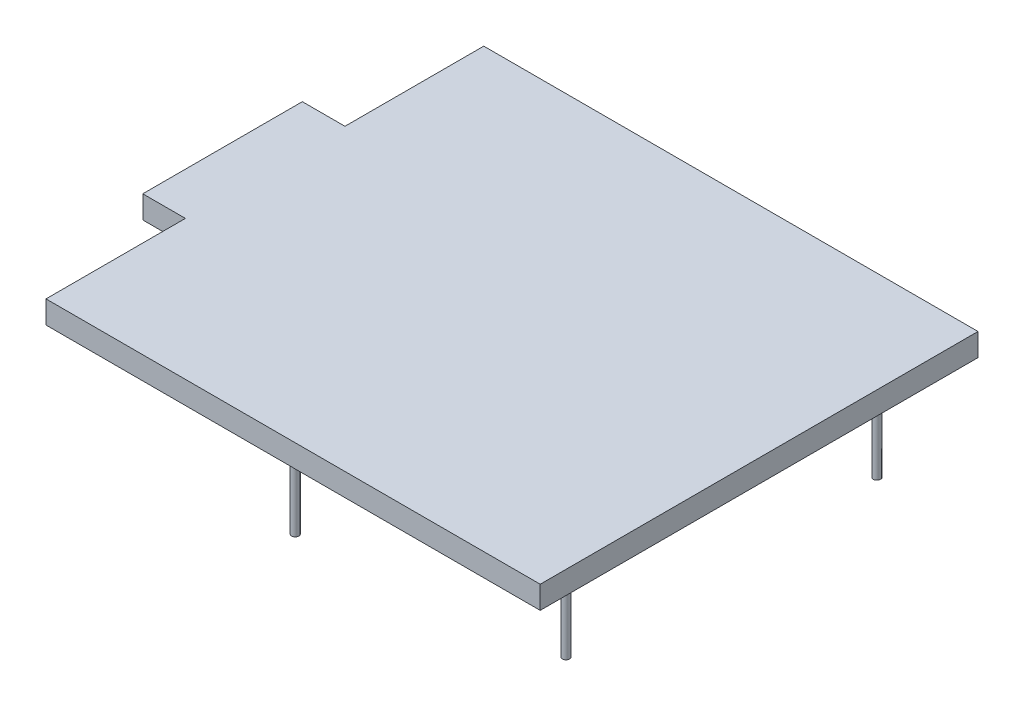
ISO-10303-21;
HEADER;
FILE_DESCRIPTION(('STEP AP214'),'2;1');
FILE_NAME('part.step','',(''),(''),'','','');
FILE_SCHEMA(('AUTOMOTIVE_DESIGN { 1 0 10303 214 1 1 1 1 }'));
ENDSEC;
DATA;
#1=APPLICATION_CONTEXT('core data for automotive mechanical design processes');
#2=APPLICATION_PROTOCOL_DEFINITION('international standard','automotive_design',2000,#1);
#3=PRODUCT_CONTEXT('',#1,'mechanical');
#4=PRODUCT('Part','Part','',(#3));
#5=PRODUCT_RELATED_PRODUCT_CATEGORY('part','',(#4));
#6=PRODUCT_DEFINITION_FORMATION('','',#4);
#7=PRODUCT_DEFINITION_CONTEXT('part definition',#1,'design');
#8=PRODUCT_DEFINITION('design','',#6,#7);
#9=PRODUCT_DEFINITION_SHAPE('','',#8);
#10=(LENGTH_UNIT() NAMED_UNIT(*) SI_UNIT(.MILLI.,.METRE.));
#11=(NAMED_UNIT(*) PLANE_ANGLE_UNIT() SI_UNIT($,.RADIAN.));
#12=(NAMED_UNIT(*) SI_UNIT($,.STERADIAN.) SOLID_ANGLE_UNIT());
#13=UNCERTAINTY_MEASURE_WITH_UNIT(LENGTH_MEASURE(1.E-05),#10,'distance_accuracy_value','');
#14=(GEOMETRIC_REPRESENTATION_CONTEXT(3) GLOBAL_UNCERTAINTY_ASSIGNED_CONTEXT((#13)) GLOBAL_UNIT_ASSIGNED_CONTEXT((#10,
#11,#12)) REPRESENTATION_CONTEXT('',''));
#15=CARTESIAN_POINT('',(0.,0.,0.));
#16=DIRECTION('',(0.,0.,1.));
#17=DIRECTION('',(1.,0.,0.));
#18=AXIS2_PLACEMENT_3D('',#15,#16,#17);
#19=CARTESIAN_POINT('',(414.922512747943,10.,-28.0236520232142));
#20=DIRECTION('',(-1.,0.,0.));
#21=DIRECTION('',(0.,0.,1.));
#22=AXIS2_PLACEMENT_3D('',#19,#20,#21);
#23=PLANE('',#22);
#24=DIRECTION('',(0.,0.,-1.));
#25=VECTOR('',#24,1.);
#26=CARTESIAN_POINT('',(414.922512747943,0.,-28.0236520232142));
#27=LINE('',#26,#25);
#28=CARTESIAN_POINT('',(414.922512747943,0.,165.016347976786));
#29=VERTEX_POINT('',#28);
#30=CARTESIAN_POINT('',(414.922512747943,0.,-28.0236520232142));
#31=VERTEX_POINT('',#30);
#32=EDGE_CURVE('E145',#29,#31,#27,.T.);
#33=ORIENTED_EDGE('',*,*,#32,.T.);
#34=DIRECTION('',(0.,-1.,0.));
#35=VECTOR('',#34,1.);
#36=CARTESIAN_POINT('',(414.922512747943,10.,-28.0236520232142));
#37=LINE('',#36,#35);
#38=CARTESIAN_POINT('',(414.922512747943,10.,-28.0236520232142));
#39=VERTEX_POINT('',#38);
#40=EDGE_CURVE('E187',#39,#31,#37,.T.);
#41=ORIENTED_EDGE('',*,*,#40,.F.);
#42=DIRECTION('',(0.,0.,-1.));
#43=VECTOR('',#42,1.);
#44=CARTESIAN_POINT('',(414.922512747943,10.,-28.0236520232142));
#45=LINE('',#44,#43);
#46=CARTESIAN_POINT('',(414.922512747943,10.,165.016347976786));
#47=VERTEX_POINT('',#46);
#48=EDGE_CURVE('E168',#47,#39,#45,.T.);
#49=ORIENTED_EDGE('',*,*,#48,.F.);
#50=DIRECTION('',(0.,-1.,0.));
#51=VECTOR('',#50,1.);
#52=CARTESIAN_POINT('',(414.922512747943,10.,165.016347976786));
#53=LINE('',#52,#51);
#54=EDGE_CURVE('E141',#47,#29,#53,.T.);
#55=ORIENTED_EDGE('',*,*,#54,.T.);
#56=EDGE_LOOP('',(#33,#41,#49,#55));
#57=FACE_BOUND('',#56,.T.);
#58=ADVANCED_FACE('F43',(#57),#23,.F.);
#59=CARTESIAN_POINT('',(196.990512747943,10.,-28.0236520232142));
#60=DIRECTION('',(0.,0.,1.));
#61=DIRECTION('',(1.,0.,0.));
#62=AXIS2_PLACEMENT_3D('',#59,#60,#61);
#63=PLANE('',#62);
#64=DIRECTION('',(-1.,0.,0.));
#65=VECTOR('',#64,1.);
#66=CARTESIAN_POINT('',(196.990512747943,0.,-28.0236520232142));
#67=LINE('',#66,#65);
#68=CARTESIAN_POINT('',(196.990512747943,0.,-28.0236520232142));
#69=VERTEX_POINT('',#68);
#70=EDGE_CURVE('E149',#31,#69,#67,.T.);
#71=ORIENTED_EDGE('',*,*,#70,.T.);
#72=DIRECTION('',(0.,-1.,0.));
#73=VECTOR('',#72,1.);
#74=CARTESIAN_POINT('',(196.990512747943,10.,-28.0236520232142));
#75=LINE('',#74,#73);
#76=CARTESIAN_POINT('',(196.990512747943,10.,-28.0236520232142));
#77=VERTEX_POINT('',#76);
#78=EDGE_CURVE('E183',#77,#69,#75,.T.);
#79=ORIENTED_EDGE('',*,*,#78,.F.);
#80=DIRECTION('',(-1.,0.,0.));
#81=VECTOR('',#80,1.);
#82=CARTESIAN_POINT('',(196.990512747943,10.,-28.0236520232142));
#83=LINE('',#82,#81);
#84=EDGE_CURVE('E104',#39,#77,#83,.T.);
#85=ORIENTED_EDGE('',*,*,#84,.F.);
#86=ORIENTED_EDGE('',*,*,#40,.T.);
#87=EDGE_LOOP('',(#71,#79,#85,#86));
#88=FACE_BOUND('',#87,.T.);
#89=ADVANCED_FACE('F228',(#88),#63,.F.);
#90=CARTESIAN_POINT('',(196.990512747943,10.,-28.0236520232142));
#91=DIRECTION('',(1.,0.,0.));
#92=DIRECTION('',(0.,0.,-1.));
#93=AXIS2_PLACEMENT_3D('',#90,#91,#92);
#94=PLANE('',#93);
#95=DIRECTION('',(0.,0.,1.));
#96=VECTOR('',#95,1.);
#97=CARTESIAN_POINT('',(196.990512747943,0.,-28.0236520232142));
#98=LINE('',#97,#96);
#99=CARTESIAN_POINT('',(196.990512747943,0.,33.1903479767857));
#100=VERTEX_POINT('',#99);
#101=EDGE_CURVE('E153',#69,#100,#98,.T.);
#102=ORIENTED_EDGE('',*,*,#101,.T.);
#103=DIRECTION('',(0.,-1.,0.));
#104=VECTOR('',#103,1.);
#105=CARTESIAN_POINT('',(196.990512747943,10.,33.1903479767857));
#106=LINE('',#105,#104);
#107=CARTESIAN_POINT('',(196.990512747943,10.,33.1903479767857));
#108=VERTEX_POINT('',#107);
#109=EDGE_CURVE('E179',#108,#100,#106,.T.);
#110=ORIENTED_EDGE('',*,*,#109,.F.);
#111=DIRECTION('',(0.,0.,1.));
#112=VECTOR('',#111,1.);
#113=CARTESIAN_POINT('',(196.990512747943,10.,-28.0236520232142));
#114=LINE('',#113,#112);
#115=EDGE_CURVE('E437',#77,#108,#114,.T.);
#116=ORIENTED_EDGE('',*,*,#115,.F.);
#117=ORIENTED_EDGE('',*,*,#78,.T.);
#118=EDGE_LOOP('',(#102,#110,#116,#117));
#119=FACE_BOUND('',#118,.T.);
#120=ADVANCED_FACE('F232',(#119),#94,.F.);
#121=CARTESIAN_POINT('',(178.194512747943,10.,33.1903479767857));
#122=DIRECTION('',(0.,0.,1.));
#123=DIRECTION('',(1.,0.,0.));
#124=AXIS2_PLACEMENT_3D('',#121,#122,#123);
#125=PLANE('',#124);
#126=DIRECTION('',(-1.,0.,0.));
#127=VECTOR('',#126,1.);
#128=CARTESIAN_POINT('',(178.194512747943,0.,33.1903479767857));
#129=LINE('',#128,#127);
#130=CARTESIAN_POINT('',(178.194512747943,0.,33.1903479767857));
#131=VERTEX_POINT('',#130);
#132=EDGE_CURVE('E156',#100,#131,#129,.T.);
#133=ORIENTED_EDGE('',*,*,#132,.T.);
#134=DIRECTION('',(0.,-1.,0.));
#135=VECTOR('',#134,1.);
#136=CARTESIAN_POINT('',(178.194512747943,10.,33.1903479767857));
#137=LINE('',#136,#135);
#138=CARTESIAN_POINT('',(178.194512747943,10.,33.1903479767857));
#139=VERTEX_POINT('',#138);
#140=EDGE_CURVE('E175',#139,#131,#137,.T.);
#141=ORIENTED_EDGE('',*,*,#140,.F.);
#142=DIRECTION('',(-1.,0.,0.));
#143=VECTOR('',#142,1.);
#144=CARTESIAN_POINT('',(178.194512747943,10.,33.1903479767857));
#145=LINE('',#144,#143);
#146=EDGE_CURVE('E440',#108,#139,#145,.T.);
#147=ORIENTED_EDGE('',*,*,#146,.F.);
#148=ORIENTED_EDGE('',*,*,#109,.T.);
#149=EDGE_LOOP('',(#133,#141,#147,#148));
#150=FACE_BOUND('',#149,.T.);
#151=ADVANCED_FACE('F236',(#150),#125,.F.);
#152=CARTESIAN_POINT('',(178.194512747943,10.,33.1903479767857));
#153=DIRECTION('',(1.,0.,0.));
#154=DIRECTION('',(0.,0.,-1.));
#155=AXIS2_PLACEMENT_3D('',#152,#153,#154);
#156=PLANE('',#155);
#157=DIRECTION('',(0.,0.,1.));
#158=VECTOR('',#157,1.);
#159=CARTESIAN_POINT('',(178.194512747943,0.,33.1903479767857));
#160=LINE('',#159,#158);
#161=CARTESIAN_POINT('',(178.194512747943,0.,103.548347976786));
#162=VERTEX_POINT('',#161);
#163=EDGE_CURVE('E159',#131,#162,#160,.T.);
#164=ORIENTED_EDGE('',*,*,#163,.T.);
#165=DIRECTION('',(0.,-1.,0.));
#166=VECTOR('',#165,1.);
#167=CARTESIAN_POINT('',(178.194512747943,10.,103.548347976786));
#168=LINE('',#167,#166);
#169=CARTESIAN_POINT('',(178.194512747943,10.,103.548347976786));
#170=VERTEX_POINT('',#169);
#171=EDGE_CURVE('E134',#170,#162,#168,.T.);
#172=ORIENTED_EDGE('',*,*,#171,.F.);
#173=DIRECTION('',(0.,0.,1.));
#174=VECTOR('',#173,1.);
#175=CARTESIAN_POINT('',(178.194512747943,10.,33.1903479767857));
#176=LINE('',#175,#174);
#177=EDGE_CURVE('E123',#139,#170,#176,.T.);
#178=ORIENTED_EDGE('',*,*,#177,.F.);
#179=ORIENTED_EDGE('',*,*,#140,.T.);
#180=EDGE_LOOP('',(#164,#172,#178,#179));
#181=FACE_BOUND('',#180,.T.);
#182=ADVANCED_FACE('F242',(#181),#156,.F.);
#183=CARTESIAN_POINT('',(178.194512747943,10.,103.548347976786));
#184=DIRECTION('',(0.,0.,-1.));
#185=DIRECTION('',(-1.,0.,0.));
#186=AXIS2_PLACEMENT_3D('',#183,#184,#185);
#187=PLANE('',#186);
#188=DIRECTION('',(1.,0.,0.));
#189=VECTOR('',#188,1.);
#190=CARTESIAN_POINT('',(178.194512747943,0.,103.548347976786));
#191=LINE('',#190,#189);
#192=CARTESIAN_POINT('',(196.990512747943,0.,103.548347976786));
#193=VERTEX_POINT('',#192);
#194=EDGE_CURVE('E132',#162,#193,#191,.T.);
#195=ORIENTED_EDGE('',*,*,#194,.T.);
#196=DIRECTION('',(0.,-1.,0.));
#197=VECTOR('',#196,1.);
#198=CARTESIAN_POINT('',(196.990512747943,10.,103.548347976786));
#199=LINE('',#198,#197);
#200=CARTESIAN_POINT('',(196.990512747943,10.,103.548347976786));
#201=VERTEX_POINT('',#200);
#202=EDGE_CURVE('E129',#201,#193,#199,.T.);
#203=ORIENTED_EDGE('',*,*,#202,.F.);
#204=DIRECTION('',(1.,0.,0.));
#205=VECTOR('',#204,1.);
#206=CARTESIAN_POINT('',(178.194512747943,10.,103.548347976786));
#207=LINE('',#206,#205);
#208=EDGE_CURVE('E117',#170,#201,#207,.T.);
#209=ORIENTED_EDGE('',*,*,#208,.F.);
#210=ORIENTED_EDGE('',*,*,#171,.T.);
#211=EDGE_LOOP('',(#195,#203,#209,#210));
#212=FACE_BOUND('',#211,.T.);
#213=ADVANCED_FACE('F130',(#212),#187,.F.);
#214=CARTESIAN_POINT('',(196.990512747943,10.,165.016347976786));
#215=DIRECTION('',(1.,0.,0.));
#216=DIRECTION('',(0.,0.,-1.));
#217=AXIS2_PLACEMENT_3D('',#214,#215,#216);
#218=PLANE('',#217);
#219=DIRECTION('',(0.,0.,1.));
#220=VECTOR('',#219,1.);
#221=CARTESIAN_POINT('',(196.990512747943,0.,165.016347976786));
#222=LINE('',#221,#220);
#223=CARTESIAN_POINT('',(196.990512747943,0.,165.016347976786));
#224=VERTEX_POINT('',#223);
#225=EDGE_CURVE('E89',#193,#224,#222,.T.);
#226=ORIENTED_EDGE('',*,*,#225,.T.);
#227=DIRECTION('',(0.,-1.,0.));
#228=VECTOR('',#227,1.);
#229=CARTESIAN_POINT('',(196.990512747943,10.,165.016347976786));
#230=LINE('',#229,#228);
#231=CARTESIAN_POINT('',(196.990512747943,10.,165.016347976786));
#232=VERTEX_POINT('',#231);
#233=EDGE_CURVE('E135',#232,#224,#230,.T.);
#234=ORIENTED_EDGE('',*,*,#233,.F.);
#235=DIRECTION('',(0.,0.,1.));
#236=VECTOR('',#235,1.);
#237=CARTESIAN_POINT('',(196.990512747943,10.,165.016347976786));
#238=LINE('',#237,#236);
#239=EDGE_CURVE('E121',#201,#232,#238,.T.);
#240=ORIENTED_EDGE('',*,*,#239,.F.);
#241=ORIENTED_EDGE('',*,*,#202,.T.);
#242=EDGE_LOOP('',(#226,#234,#240,#241));
#243=FACE_BOUND('',#242,.T.);
#244=ADVANCED_FACE('F137',(#243),#218,.F.);
#245=CARTESIAN_POINT('',(196.990512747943,10.,165.016347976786));
#246=DIRECTION('',(0.,0.,-1.));
#247=DIRECTION('',(-1.,0.,0.));
#248=AXIS2_PLACEMENT_3D('',#245,#246,#247);
#249=PLANE('',#248);
#250=DIRECTION('',(1.,0.,0.));
#251=VECTOR('',#250,1.);
#252=CARTESIAN_POINT('',(196.990512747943,0.,165.016347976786));
#253=LINE('',#252,#251);
#254=EDGE_CURVE('E95',#224,#29,#253,.T.);
#255=ORIENTED_EDGE('',*,*,#254,.T.);
#256=ORIENTED_EDGE('',*,*,#54,.F.);
#257=DIRECTION('',(1.,0.,0.));
#258=VECTOR('',#257,1.);
#259=CARTESIAN_POINT('',(196.990512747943,10.,165.016347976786));
#260=LINE('',#259,#258);
#261=EDGE_CURVE('E60',#232,#47,#260,.T.);
#262=ORIENTED_EDGE('',*,*,#261,.F.);
#263=ORIENTED_EDGE('',*,*,#233,.T.);
#264=EDGE_LOOP('',(#255,#256,#262,#263));
#265=FACE_BOUND('',#264,.T.);
#266=ADVANCED_FACE('F218',(#265),#249,.F.);
#267=CARTESIAN_POINT('',(0.,10.,0.));
#268=DIRECTION('',(0.,1.,0.));
#269=DIRECTION('',(0.,0.,1.));
#270=AXIS2_PLACEMENT_3D('',#267,#268,#269);
#271=PLANE('',#270);
#272=ORIENTED_EDGE('',*,*,#48,.T.);
#273=ORIENTED_EDGE('',*,*,#84,.T.);
#274=ORIENTED_EDGE('',*,*,#115,.T.);
#275=ORIENTED_EDGE('',*,*,#146,.T.);
#276=ORIENTED_EDGE('',*,*,#177,.T.);
#277=ORIENTED_EDGE('',*,*,#208,.T.);
#278=ORIENTED_EDGE('',*,*,#239,.T.);
#279=ORIENTED_EDGE('',*,*,#261,.T.);
#280=EDGE_LOOP('',(#272,#273,#274,#275,#276,#277,#278,#279));
#281=FACE_BOUND('',#280,.T.);
#282=ADVANCED_FACE('F119',(#281),#271,.T.);
#283=CARTESIAN_POINT('',(0.,0.,0.));
#284=DIRECTION('',(0.,1.,0.));
#285=DIRECTION('',(0.,0.,1.));
#286=AXIS2_PLACEMENT_3D('',#283,#284,#285);
#287=PLANE('',#286);
#288=CARTESIAN_POINT('',(291.613302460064,0.,-12.7175107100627));
#289=DIRECTION('',(0.,1.,0.));
#290=DIRECTION('',(0.,0.,1.));
#291=AXIS2_PLACEMENT_3D('',#288,#289,#290);
#292=CIRCLE('',#291,1.60000000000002);
#293=CARTESIAN_POINT('',(291.613302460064,0.,-11.1175107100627));
#294=VERTEX_POINT('',#293);
#295=EDGE_CURVE('E11',#294,#294,#292,.F.);
#296=ORIENTED_EDGE('',*,*,#295,.F.);
#297=EDGE_LOOP('',(#296));
#298=FACE_BOUND('',#297,.T.);
#299=CARTESIAN_POINT('',(398.306929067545,0.,-0.0747479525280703));
#300=DIRECTION('',(0.,1.,0.));
#301=DIRECTION('',(0.,0.,1.));
#302=AXIS2_PLACEMENT_3D('',#299,#300,#301);
#303=CIRCLE('',#302,1.5999999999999);
#304=CARTESIAN_POINT('',(398.306929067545,0.,1.52525204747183));
#305=VERTEX_POINT('',#304);
#306=EDGE_CURVE('E52',#305,#305,#303,.F.);
#307=ORIENTED_EDGE('',*,*,#306,.F.);
#308=EDGE_LOOP('',(#307));
#309=FACE_BOUND('',#308,.T.);
#310=CARTESIAN_POINT('',(398.380512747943,0.,137.085232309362));
#311=DIRECTION('',(0.,1.,0.));
#312=DIRECTION('',(0.,0.,1.));
#313=AXIS2_PLACEMENT_3D('',#310,#311,#312);
#314=CIRCLE('',#313,1.59999999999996);
#315=CARTESIAN_POINT('',(398.380512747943,0.,138.685232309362));
#316=VERTEX_POINT('',#315);
#317=EDGE_CURVE('E194',#316,#316,#314,.F.);
#318=ORIENTED_EDGE('',*,*,#317,.F.);
#319=EDGE_LOOP('',(#318));
#320=FACE_BOUND('',#319,.T.);
#321=CARTESIAN_POINT('',(291.700512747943,0.,149.842465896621));
#322=DIRECTION('',(0.,1.,0.));
#323=DIRECTION('',(0.,0.,1.));
#324=AXIS2_PLACEMENT_3D('',#321,#322,#323);
#325=CIRCLE('',#324,1.60000000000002);
#326=CARTESIAN_POINT('',(291.700512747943,0.,151.442465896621));
#327=VERTEX_POINT('',#326);
#328=EDGE_CURVE('E190',#327,#327,#325,.F.);
#329=ORIENTED_EDGE('',*,*,#328,.F.);
#330=EDGE_LOOP('',(#329));
#331=FACE_BOUND('',#330,.T.);
#332=ORIENTED_EDGE('',*,*,#32,.F.);
#333=ORIENTED_EDGE('',*,*,#254,.F.);
#334=ORIENTED_EDGE('',*,*,#225,.F.);
#335=ORIENTED_EDGE('',*,*,#194,.F.);
#336=ORIENTED_EDGE('',*,*,#163,.F.);
#337=ORIENTED_EDGE('',*,*,#132,.F.);
#338=ORIENTED_EDGE('',*,*,#101,.F.);
#339=ORIENTED_EDGE('',*,*,#70,.F.);
#340=EDGE_LOOP('',(#332,#333,#334,#335,#336,#337,#338,#339));
#341=FACE_BOUND('',#340,.T.);
#342=ADVANCED_FACE('F203',(#298,#309,#320,#331,#341),#287,.F.);
#343=CARTESIAN_POINT('',(291.700512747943,-40.,149.842465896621));
#344=DIRECTION('',(0.,1.,0.));
#345=DIRECTION('',(0.,0.,1.));
#346=AXIS2_PLACEMENT_3D('',#343,#344,#345);
#347=CYLINDRICAL_SURFACE('',#346,1.60000000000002);
#348=CARTESIAN_POINT('',(291.700512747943,-40.,149.842465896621));
#349=DIRECTION('',(0.,-1.,0.));
#350=DIRECTION('',(0.,0.,-1.));
#351=AXIS2_PLACEMENT_3D('',#348,#349,#350);
#352=CIRCLE('',#351,1.60000000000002);
#353=CARTESIAN_POINT('',(291.700512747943,-40.,148.242465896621));
#354=VERTEX_POINT('',#353);
#355=EDGE_CURVE('E150',#354,#354,#352,.T.);
#356=ORIENTED_EDGE('',*,*,#355,.F.);
#357=EDGE_LOOP('',(#356));
#358=FACE_BOUND('',#357,.T.);
#359=ORIENTED_EDGE('',*,*,#328,.T.);
#360=EDGE_LOOP('',(#359));
#361=FACE_BOUND('',#360,.T.);
#362=ADVANCED_FACE('F206',(#358,#361),#347,.T.);
#363=CARTESIAN_POINT('',(291.700512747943,-40.,149.842465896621));
#364=DIRECTION('',(0.,-1.,0.));
#365=DIRECTION('',(0.,0.,-1.));
#366=AXIS2_PLACEMENT_3D('',#363,#364,#365);
#367=PLANE('',#366);
#368=ORIENTED_EDGE('',*,*,#355,.T.);
#369=EDGE_LOOP('',(#368));
#370=FACE_BOUND('',#369,.T.);
#371=ADVANCED_FACE('F285',(#370),#367,.T.);
#372=CARTESIAN_POINT('',(398.380512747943,-40.,137.085232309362));
#373=DIRECTION('',(0.,1.,0.));
#374=DIRECTION('',(0.,0.,1.));
#375=AXIS2_PLACEMENT_3D('',#372,#373,#374);
#376=CYLINDRICAL_SURFACE('',#375,1.59999999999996);
#377=CARTESIAN_POINT('',(398.380512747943,-40.,137.085232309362));
#378=DIRECTION('',(0.,-1.,0.));
#379=DIRECTION('',(0.,0.,-1.));
#380=AXIS2_PLACEMENT_3D('',#377,#378,#379);
#381=CIRCLE('',#380,1.59999999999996);
#382=CARTESIAN_POINT('',(398.380512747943,-40.,135.485232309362));
#383=VERTEX_POINT('',#382);
#384=EDGE_CURVE('E424',#383,#383,#381,.T.);
#385=ORIENTED_EDGE('',*,*,#384,.F.);
#386=EDGE_LOOP('',(#385));
#387=FACE_BOUND('',#386,.T.);
#388=ORIENTED_EDGE('',*,*,#317,.T.);
#389=EDGE_LOOP('',(#388));
#390=FACE_BOUND('',#389,.T.);
#391=ADVANCED_FACE('F296',(#387,#390),#376,.T.);
#392=CARTESIAN_POINT('',(398.380512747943,-40.,137.085232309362));
#393=DIRECTION('',(0.,-1.,0.));
#394=DIRECTION('',(0.,0.,-1.));
#395=AXIS2_PLACEMENT_3D('',#392,#393,#394);
#396=PLANE('',#395);
#397=ORIENTED_EDGE('',*,*,#384,.T.);
#398=EDGE_LOOP('',(#397));
#399=FACE_BOUND('',#398,.T.);
#400=ADVANCED_FACE('F307',(#399),#396,.T.);
#401=CARTESIAN_POINT('',(398.306929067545,-40.,-0.0747479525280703));
#402=DIRECTION('',(0.,1.,0.));
#403=DIRECTION('',(0.,0.,1.));
#404=AXIS2_PLACEMENT_3D('',#401,#402,#403);
#405=CYLINDRICAL_SURFACE('',#404,1.5999999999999);
#406=CARTESIAN_POINT('',(398.306929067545,-40.,-0.0747479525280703));
#407=DIRECTION('',(0.,-1.,0.));
#408=DIRECTION('',(0.,0.,1.));
#409=AXIS2_PLACEMENT_3D('',#406,#407,#408);
#410=CIRCLE('',#409,1.5999999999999);
#411=CARTESIAN_POINT('',(398.306929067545,-40.,1.52525204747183));
#412=VERTEX_POINT('',#411);
#413=EDGE_CURVE('E420',#412,#412,#410,.T.);
#414=ORIENTED_EDGE('',*,*,#413,.F.);
#415=EDGE_LOOP('',(#414));
#416=FACE_BOUND('',#415,.T.);
#417=ORIENTED_EDGE('',*,*,#306,.T.);
#418=EDGE_LOOP('',(#417));
#419=FACE_BOUND('',#418,.T.);
#420=ADVANCED_FACE('F201',(#416,#419),#405,.T.);
#421=CARTESIAN_POINT('',(398.306929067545,-40.,-0.0747479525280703));
#422=DIRECTION('',(0.,1.,0.));
#423=DIRECTION('',(0.,0.,1.));
#424=AXIS2_PLACEMENT_3D('',#421,#422,#423);
#425=PLANE('',#424);
#426=ORIENTED_EDGE('',*,*,#413,.T.);
#427=EDGE_LOOP('',(#426));
#428=FACE_BOUND('',#427,.T.);
#429=ADVANCED_FACE('F328',(#428),#425,.F.);
#430=CARTESIAN_POINT('',(291.613302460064,-40.,-12.7175107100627));
#431=DIRECTION('',(0.,1.,0.));
#432=DIRECTION('',(0.,0.,1.));
#433=AXIS2_PLACEMENT_3D('',#430,#431,#432);
#434=CYLINDRICAL_SURFACE('',#433,1.60000000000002);
#435=CARTESIAN_POINT('',(291.613302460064,-40.,-12.7175107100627));
#436=DIRECTION('',(0.,-1.,0.));
#437=DIRECTION('',(0.,0.,1.));
#438=AXIS2_PLACEMENT_3D('',#435,#436,#437);
#439=CIRCLE('',#438,1.60000000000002);
#440=CARTESIAN_POINT('',(291.613302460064,-40.,-11.1175107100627));
#441=VERTEX_POINT('',#440);
#442=EDGE_CURVE('E418',#441,#441,#439,.T.);
#443=ORIENTED_EDGE('',*,*,#442,.F.);
#444=EDGE_LOOP('',(#443));
#445=FACE_BOUND('',#444,.T.);
#446=ORIENTED_EDGE('',*,*,#295,.T.);
#447=EDGE_LOOP('',(#446));
#448=FACE_BOUND('',#447,.T.);
#449=ADVANCED_FACE('F339',(#445,#448),#434,.T.);
#450=CARTESIAN_POINT('',(291.613302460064,-40.,-12.7175107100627));
#451=DIRECTION('',(0.,1.,0.));
#452=DIRECTION('',(0.,0.,1.));
#453=AXIS2_PLACEMENT_3D('',#450,#451,#452);
#454=PLANE('',#453);
#455=ORIENTED_EDGE('',*,*,#442,.T.);
#456=EDGE_LOOP('',(#455));
#457=FACE_BOUND('',#456,.T.);
#458=ADVANCED_FACE('F350',(#457),#454,.F.);
#459=CLOSED_SHELL('',(#58,#89,#120,#151,#182,#213,#244,#266,#282,#342,#362,#371,#391,#400,#420,
#429,#449,#458));
#460=MANIFOLD_SOLID_BREP('B2',#459);
#461=ADVANCED_BREP_SHAPE_REPRESENTATION('',(#18,#460),#14);
#462=SHAPE_DEFINITION_REPRESENTATION(#9,#461);
ENDSEC;
END-ISO-10303-21;
